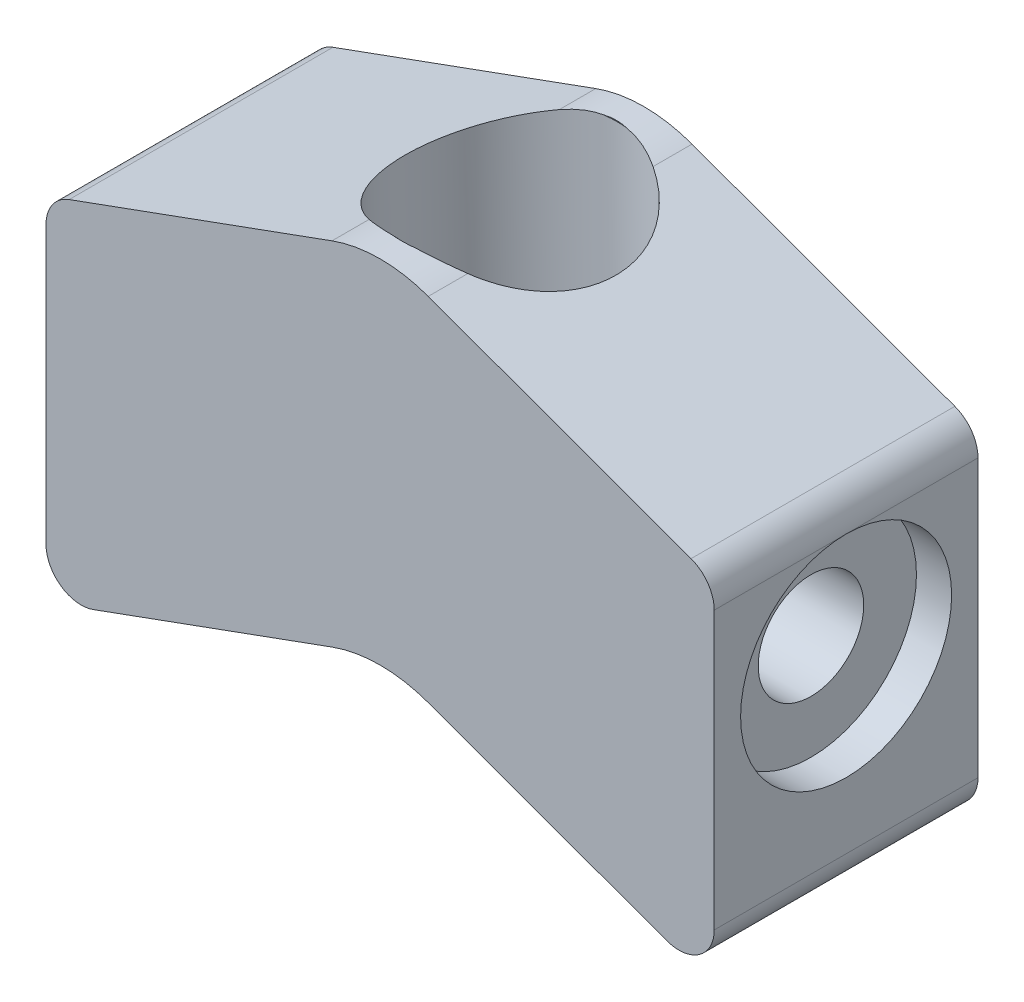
ISO-10303-21;
HEADER;
FILE_DESCRIPTION(('STEP AP214'),'2;1');
FILE_NAME('part.step','',(''),(''),'','','');
FILE_SCHEMA(('AUTOMOTIVE_DESIGN { 1 0 10303 214 1 1 1 1 }'));
ENDSEC;
DATA;
#1=APPLICATION_CONTEXT('core data for automotive mechanical design processes');
#2=APPLICATION_PROTOCOL_DEFINITION('international standard','automotive_design',2000,#1);
#3=PRODUCT_CONTEXT('',#1,'mechanical');
#4=PRODUCT('Part','Part','',(#3));
#5=PRODUCT_RELATED_PRODUCT_CATEGORY('part','',(#4));
#6=PRODUCT_DEFINITION_FORMATION('','',#4);
#7=PRODUCT_DEFINITION_CONTEXT('part definition',#1,'design');
#8=PRODUCT_DEFINITION('design','',#6,#7);
#9=PRODUCT_DEFINITION_SHAPE('','',#8);
#10=(LENGTH_UNIT() NAMED_UNIT(*) SI_UNIT(.MILLI.,.METRE.));
#11=(NAMED_UNIT(*) PLANE_ANGLE_UNIT() SI_UNIT($,.RADIAN.));
#12=(NAMED_UNIT(*) SI_UNIT($,.STERADIAN.) SOLID_ANGLE_UNIT());
#13=UNCERTAINTY_MEASURE_WITH_UNIT(LENGTH_MEASURE(1.E-05),#10,'distance_accuracy_value','');
#14=(GEOMETRIC_REPRESENTATION_CONTEXT(3) GLOBAL_UNCERTAINTY_ASSIGNED_CONTEXT((#13)) GLOBAL_UNIT_ASSIGNED_CONTEXT((#10,
#11,#12)) REPRESENTATION_CONTEXT('',''));
#15=CARTESIAN_POINT('',(0.,0.,0.));
#16=DIRECTION('',(0.,0.,1.));
#17=DIRECTION('',(1.,0.,0.));
#18=AXIS2_PLACEMENT_3D('',#15,#16,#17);
#19=CARTESIAN_POINT('',(-19.,14.2041147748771,7.5));
#20=DIRECTION('',(1.,0.,0.));
#21=DIRECTION('',(0.,0.,-1.));
#22=AXIS2_PLACEMENT_3D('',#19,#20,#21);
#23=CYLINDRICAL_SURFACE('',#22,3.);
#24=CARTESIAN_POINT('',(-5.10274213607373,14.2041147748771,4.5));
#25=CARTESIAN_POINT('',(-5.1041707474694,14.282869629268,4.50000094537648));
#26=CARTESIAN_POINT('',(-5.10738078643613,14.3616034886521,4.50310753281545));
#27=CARTESIAN_POINT('',(-5.11726853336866,14.5183790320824,4.51546712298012));
#28=CARTESIAN_POINT('',(-5.12394794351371,14.5964203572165,4.52472314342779));
#29=CARTESIAN_POINT('',(-5.14893021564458,14.8288373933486,4.56158424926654));
#30=CARTESIAN_POINT('',(-5.17217372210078,14.9813509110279,4.59828202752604));
#31=CARTESIAN_POINT('',(-5.22872337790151,15.2761346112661,4.69380659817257));
#32=CARTESIAN_POINT('',(-5.26197370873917,15.4184563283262,4.75251107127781));
#33=CARTESIAN_POINT('',(-5.33492998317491,15.6911669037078,4.89002010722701));
#34=CARTESIAN_POINT('',(-5.37463606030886,15.8215555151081,4.96882508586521));
#35=CARTESIAN_POINT('',(-5.46033207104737,16.0789913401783,5.15225188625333));
#36=CARTESIAN_POINT('',(-5.50656885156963,16.2047916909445,5.25850880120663));
#37=CARTESIAN_POINT('',(-5.597772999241,16.4376600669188,5.49044870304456));
#38=CARTESIAN_POINT('',(-5.64273971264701,16.544718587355,5.61614148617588));
#39=CARTESIAN_POINT('',(-5.7297399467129,16.7434488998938,5.89296948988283));
#40=CARTESIAN_POINT('',(-5.77142325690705,16.8337703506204,6.04519371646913));
#41=CARTESIAN_POINT('',(-5.84385154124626,16.9868937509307,6.36529816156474));
#42=CARTESIAN_POINT('',(-5.87460454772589,17.0497159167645,6.53316676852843));
#43=CARTESIAN_POINT('',(-5.91954451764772,17.140902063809,6.86552470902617));
#44=CARTESIAN_POINT('',(-5.93485802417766,17.1716166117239,7.02921389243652));
#45=CARTESIAN_POINT('',(-5.95127264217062,17.2054527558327,7.36008873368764));
#46=CARTESIAN_POINT('',(-5.95238249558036,17.2085913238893,7.52727217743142));
#47=CARTESIAN_POINT('',(-5.94079876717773,17.1881387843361,7.84431516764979));
#48=CARTESIAN_POINT('',(-5.92933627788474,17.166923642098,7.99438176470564));
#49=CARTESIAN_POINT('',(-5.89560082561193,17.1025643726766,8.28844683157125));
#50=CARTESIAN_POINT('',(-5.87332690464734,17.0594183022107,8.43244476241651));
#51=CARTESIAN_POINT('',(-5.81943820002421,16.9519692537,8.71339488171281));
#52=CARTESIAN_POINT('',(-5.78766571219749,16.8873068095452,8.85017817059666));
#53=CARTESIAN_POINT('',(-5.71757500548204,16.739144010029,9.11126857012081));
#54=CARTESIAN_POINT('',(-5.67925439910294,16.655636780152,9.23557110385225));
#55=CARTESIAN_POINT('',(-5.59497200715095,16.4624845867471,9.4815707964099));
#56=CARTESIAN_POINT('',(-5.54862937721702,16.3510510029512,9.60173510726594));
#57=CARTESIAN_POINT('',(-5.45584056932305,16.110147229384,9.82245351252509));
#58=CARTESIAN_POINT('',(-5.40939433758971,15.9806623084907,9.92299142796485));
#59=CARTESIAN_POINT('',(-5.31785503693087,15.6961185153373,10.1085783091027));
#60=CARTESIAN_POINT('',(-5.27308532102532,15.5399029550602,10.1920464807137));
#61=CARTESIAN_POINT('',(-5.21421882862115,15.2948541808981,10.2961028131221));
#62=CARTESIAN_POINT('',(-5.19597501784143,15.2113648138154,10.3272683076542));
#63=CARTESIAN_POINT('',(-5.16292380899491,15.0413427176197,10.3821888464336));
#64=CARTESIAN_POINT('',(-5.14811426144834,14.9548119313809,10.4059485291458));
#65=CARTESIAN_POINT('',(-5.1235388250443,14.7862554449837,10.4441448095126));
#66=CARTESIAN_POINT('',(-5.11346936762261,14.7044056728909,10.4591645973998));
#67=CARTESIAN_POINT('',(-5.09714101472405,14.5394043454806,10.4823676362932));
#68=CARTESIAN_POINT('',(-5.09088009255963,14.4562535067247,10.4905545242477));
#69=CARTESIAN_POINT('',(-5.08239546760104,14.2893838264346,10.4999509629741));
#70=CARTESIAN_POINT('',(-5.08016996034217,14.2056652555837,10.5011636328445));
#71=CARTESIAN_POINT('',(-5.07979835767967,14.0384373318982,10.4965911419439));
#72=CARTESIAN_POINT('',(-5.08165194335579,13.9549279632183,10.4908065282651));
#73=CARTESIAN_POINT('',(-5.09228556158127,13.7253107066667,10.4652039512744));
#74=CARTESIAN_POINT('',(-5.1052765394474,13.5801386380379,10.4380396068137));
#75=CARTESIAN_POINT('',(-5.14180412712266,13.296667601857,10.3632311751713));
#76=CARTESIAN_POINT('',(-5.16534412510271,13.1583708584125,10.3155805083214));
#77=CARTESIAN_POINT('',(-5.22119566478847,12.8861243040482,10.199198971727));
#78=CARTESIAN_POINT('',(-5.25381902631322,12.7525665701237,10.1297045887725));
#79=CARTESIAN_POINT('',(-5.32383836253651,12.4981784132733,9.97228436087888));
#80=CARTESIAN_POINT('',(-5.36123666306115,12.3773542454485,9.88434952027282));
#81=CARTESIAN_POINT('',(-5.44209930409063,12.1360786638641,9.67973877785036));
#82=CARTESIAN_POINT('',(-5.48573793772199,12.0175581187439,9.56084502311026));
#83=CARTESIAN_POINT('',(-5.57007183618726,11.8014976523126,9.30431784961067));
#84=CARTESIAN_POINT('',(-5.61076607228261,11.703965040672,9.1666779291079));
#85=CARTESIAN_POINT('',(-5.68613704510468,11.5300625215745,8.87102821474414));
#86=CARTESIAN_POINT('',(-5.72059294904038,11.454427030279,8.71252596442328));
#87=CARTESIAN_POINT('',(-5.77790910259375,11.3316037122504,8.38291686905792));
#88=CARTESIAN_POINT('',(-5.80077864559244,11.2843930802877,8.21182025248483));
#89=CARTESIAN_POINT('',(-5.83080257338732,11.2235530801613,7.87762127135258));
#90=CARTESIAN_POINT('',(-5.83913167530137,11.2074014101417,7.71508301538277));
#91=CARTESIAN_POINT('',(-5.8428899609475,11.2017382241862,7.38941676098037));
#92=CARTESIAN_POINT('',(-5.83832350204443,11.2122177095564,7.22628898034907));
#93=CARTESIAN_POINT('',(-5.81753856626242,11.257786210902,6.91488798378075));
#94=CARTESIAN_POINT('',(-5.80207177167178,11.2912843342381,6.7663261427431));
#95=CARTESIAN_POINT('',(-5.76182333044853,11.3798254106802,6.4771271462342));
#96=CARTESIAN_POINT('',(-5.73704039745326,11.434871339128,6.33649108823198));
#97=CARTESIAN_POINT('',(-5.67924229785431,11.5672713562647,6.06076760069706));
#98=CARTESIAN_POINT('',(-5.64593577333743,11.6454346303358,5.92613177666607));
#99=CARTESIAN_POINT('',(-5.57467464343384,11.8208748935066,5.67130647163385));
#100=CARTESIAN_POINT('',(-5.53671790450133,11.9181606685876,5.55112367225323));
#101=CARTESIAN_POINT('',(-5.4559422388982,12.1395771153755,5.3168757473));
#102=CARTESIAN_POINT('',(-5.41299914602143,12.2653618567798,5.20441551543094));
#103=CARTESIAN_POINT('',(-5.33031425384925,12.5348873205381,5.00158014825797));
#104=CARTESIAN_POINT('',(-5.29057498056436,12.678641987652,4.9112223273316));
#105=CARTESIAN_POINT('',(-5.23681668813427,12.9070253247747,4.79349863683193));
#106=CARTESIAN_POINT('',(-5.21970719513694,12.9862896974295,4.75690573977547));
#107=CARTESIAN_POINT('',(-5.18833710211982,13.148178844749,4.69061635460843));
#108=CARTESIAN_POINT('',(-5.17407502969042,13.2308018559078,4.66091630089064));
#109=CARTESIAN_POINT('',(-5.14904743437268,13.398601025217,4.60883276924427));
#110=CARTESIAN_POINT('',(-5.13827303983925,13.4837700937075,4.58643072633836));
#111=CARTESIAN_POINT('',(-5.12069547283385,13.6561003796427,4.54916263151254));
#112=CARTESIAN_POINT('',(-5.1138895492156,13.7432601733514,4.53429135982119));
#113=CARTESIAN_POINT('',(-5.1059765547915,13.892807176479,4.51554511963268));
#114=CARTESIAN_POINT('',(-5.10377954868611,13.9549003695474,4.50971901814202));
#115=CARTESIAN_POINT('',(-5.10159664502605,14.0793716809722,4.50194600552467));
#116=CARTESIAN_POINT('',(-5.10161083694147,14.1417498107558,4.49999925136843));
#117=CARTESIAN_POINT('',(-5.10274213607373,14.2041147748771,4.5));
#118=B_SPLINE_CURVE_WITH_KNOTS('',3,(#24,#25,#26,#27,#28,#29,#30,#31,#32,#33,#34,#35,#36,#37,
#38,#39,#40,#41,#42,#43,#44,#45,#46,#47,#48,#49,#50,#51,#52,#53,#54,#55,#56,#57,#58,#59,#60,#61,
#62,#63,#64,#65,#66,#67,#68,#69,#70,#71,#72,#73,#74,#75,#76,#77,#78,#79,#80,#81,#82,#83,#84,#85,
#86,#87,#88,#89,#90,#91,#92,#93,#94,#95,#96,#97,#98,#99,#100,#101,#102,#103,#104,#105,#106,#107,
#108,#109,#110,#111,#112,#113,#114,#115,#116,#117),.UNSPECIFIED.,.T.,.F.,(4,2,2,2,2,2,2,2,2,2,2,
2,2,2,2,2,2,2,2,2,2,2,2,2,2,2,2,2,2,2,2,2,2,2,2,2,2,2,2,2,2,2,2,2,2,2,4),(0.,0.236234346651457,
0.472584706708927,0.945744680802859,1.41631278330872,1.88689062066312,2.39784947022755,
2.90906670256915,3.45170831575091,3.99395033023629,4.49290239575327,4.99154735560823,
5.44539589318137,5.89928465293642,6.36117270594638,6.82322952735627,7.33198233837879,
7.84115278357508,8.38603284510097,8.65858866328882,8.93097342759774,9.1820858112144,
9.43306444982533,9.6839308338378,9.9347776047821,10.3773369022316,10.8200384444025,
11.2803595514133,11.7409057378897,12.2589659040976,12.7772062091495,13.3112188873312,
13.8448025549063,14.3328437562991,14.8207200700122,15.2778808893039,15.7351048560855,
16.2107438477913,16.6866018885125,17.2066560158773,17.7271162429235,17.993697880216,
18.2601413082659,18.525901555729,18.7914773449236,18.9785407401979,19.1656117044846),.UNSPECIFIED.);
#119=CARTESIAN_POINT('',(-5.10274213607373,14.2041147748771,4.5));
#120=VERTEX_POINT('',#119);
#121=EDGE_CURVE('E313',#120,#120,#118,.T.);
#122=ORIENTED_EDGE('',*,*,#121,.T.);
#123=EDGE_LOOP('',(#122));
#124=FACE_BOUND('',#123,.T.);
#125=CARTESIAN_POINT('',(-17.,14.2041147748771,7.5));
#126=DIRECTION('',(1.,0.,0.));
#127=DIRECTION('',(0.,0.,-1.));
#128=AXIS2_PLACEMENT_3D('',#125,#126,#127);
#129=CIRCLE('',#128,3.);
#130=CARTESIAN_POINT('',(-17.,14.2041147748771,4.5));
#131=VERTEX_POINT('',#130);
#132=EDGE_CURVE('E377',#131,#131,#129,.T.);
#133=ORIENTED_EDGE('',*,*,#132,.F.);
#134=EDGE_LOOP('',(#133));
#135=FACE_BOUND('',#134,.T.);
#136=ADVANCED_FACE('F39',(#124,#135),#23,.F.);
#137=CARTESIAN_POINT('',(0.,0.,15.));
#138=DIRECTION('',(0.,0.,-1.));
#139=DIRECTION('',(-1.,0.,0.));
#140=AXIS2_PLACEMENT_3D('',#137,#138,#139);
#141=CYLINDRICAL_SURFACE('',#140,8.);
#142=DIRECTION('',(0.,0.,-1.));
#143=VECTOR('',#142,1.);
#144=CARTESIAN_POINT('',(2.73616114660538,7.51754096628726,15.));
#145=LINE('',#144,#143);
#146=CARTESIAN_POINT('',(2.73616114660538,7.51754096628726,2.03096166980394));
#147=VERTEX_POINT('',#146);
#148=CARTESIAN_POINT('',(2.73616114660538,7.51754096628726,0.));
#149=VERTEX_POINT('',#148);
#150=EDGE_CURVE('E268',#147,#149,#145,.T.);
#151=ORIENTED_EDGE('',*,*,#150,.F.);
#152=CARTESIAN_POINT('',(2.73616114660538,7.51754096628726,2.03096166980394));
#153=CARTESIAN_POINT('',(2.61232678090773,7.56262916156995,1.97431822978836));
#154=CARTESIAN_POINT('',(2.48578915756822,7.60520376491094,1.92148051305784));
#155=CARTESIAN_POINT('',(2.22779684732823,7.68473105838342,1.8239553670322));
#156=CARTESIAN_POINT('',(2.09633882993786,7.72167985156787,1.77927358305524));
#157=CARTESIAN_POINT('',(1.82886143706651,7.7893743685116,1.6985865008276));
#158=CARTESIAN_POINT('',(1.69283229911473,7.82010568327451,1.6626013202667));
#159=CARTESIAN_POINT('',(1.4173112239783,7.87470260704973,1.59998660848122));
#160=CARTESIAN_POINT('',(1.27782009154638,7.8985697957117,1.57335492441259));
#161=CARTESIAN_POINT('',(0.995646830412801,7.93908623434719,1.52980005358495));
#162=CARTESIAN_POINT('',(0.852953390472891,7.95570337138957,1.51291995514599));
#163=CARTESIAN_POINT('',(0.566042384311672,7.98124900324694,1.48939449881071));
#164=CARTESIAN_POINT('',(0.421824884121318,7.99017782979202,1.48274869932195));
#165=CARTESIAN_POINT('',(0.133269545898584,8.00019021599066,1.47988060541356));
#166=CARTESIAN_POINT('',(-0.011067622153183,8.00128769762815,1.48363979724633));
#167=CARTESIAN_POINT('',(-0.298933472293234,7.99570887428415,1.50155500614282));
#168=CARTESIAN_POINT('',(-0.442462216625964,7.98903317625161,1.51571021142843));
#169=CARTESIAN_POINT('',(-0.719420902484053,7.96872649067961,1.55315151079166));
#170=CARTESIAN_POINT('',(-0.852959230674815,7.9555147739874,1.57586958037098));
#171=CARTESIAN_POINT('',(-1.11747701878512,7.92268981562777,1.63015227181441));
#172=CARTESIAN_POINT('',(-1.24845543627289,7.90307402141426,1.66172042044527));
#173=CARTESIAN_POINT('',(-1.50704162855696,7.85786617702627,1.73335048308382));
#174=CARTESIAN_POINT('',(-1.63464849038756,7.83227252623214,1.7734146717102));
#175=CARTESIAN_POINT('',(-1.8858003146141,7.77562419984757,1.86161193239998));
#176=CARTESIAN_POINT('',(-2.00934500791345,7.74456916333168,1.90974553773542));
#177=CARTESIAN_POINT('',(-2.23529243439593,7.68213970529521,2.00654011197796));
#178=CARTESIAN_POINT('',(-2.3382831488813,7.65138468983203,2.05423663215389));
#179=CARTESIAN_POINT('',(-2.54021918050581,7.58673248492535,2.15484039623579));
#180=CARTESIAN_POINT('',(-2.63917661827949,7.5528458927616,2.20773010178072));
#181=CARTESIAN_POINT('',(-2.73616114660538,7.51754096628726,2.26314372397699));
#182=B_SPLINE_CURVE_WITH_KNOTS('',3,(#152,#153,#154,#155,#156,#157,#158,#159,#160,#161,#162,
#163,#164,#165,#166,#167,#168,#169,#170,#171,#172,#173,#174,#175,#176,#177,#178,#179,#180,#181),
.UNSPECIFIED.,.F.,.F.,(4,2,2,2,2,2,2,2,2,2,2,2,2,2,4),(0.,0.430297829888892,0.860892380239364,
1.2924736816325,1.72395558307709,2.15732972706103,2.59068517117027,3.0232700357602,
3.45582112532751,3.8636534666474,4.27164856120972,4.67975302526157,5.08788446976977,
5.44043672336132,5.79183681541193),.UNSPECIFIED.);
#183=CARTESIAN_POINT('',(-2.73616114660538,7.51754096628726,2.26314372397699));
#184=VERTEX_POINT('',#183);
#185=EDGE_CURVE('E289',#147,#184,#182,.T.);
#186=ORIENTED_EDGE('',*,*,#185,.T.);
#187=DIRECTION('',(0.,0.,-1.));
#188=VECTOR('',#187,1.);
#189=CARTESIAN_POINT('',(-2.73616114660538,7.51754096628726,15.));
#190=LINE('',#189,#188);
#191=CARTESIAN_POINT('',(-2.73616114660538,7.51754096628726,0.));
#192=VERTEX_POINT('',#191);
#193=EDGE_CURVE('E418',#184,#192,#190,.T.);
#194=ORIENTED_EDGE('',*,*,#193,.T.);
#195=CARTESIAN_POINT('',(0.,0.,0.));
#196=DIRECTION('',(0.,0.,-1.));
#197=DIRECTION('',(1.,0.,0.));
#198=AXIS2_PLACEMENT_3D('',#195,#196,#197);
#199=CIRCLE('',#198,8.);
#200=EDGE_CURVE('E393',#192,#149,#199,.T.);
#201=ORIENTED_EDGE('',*,*,#200,.T.);
#202=EDGE_LOOP('',(#151,#186,#194,#201));
#203=FACE_BOUND('',#202,.T.);
#204=ADVANCED_FACE('F365',(#203),#141,.F.);
#205=CARTESIAN_POINT('',(0.,20.0065421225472,15.));
#206=DIRECTION('',(0.,0.,-1.));
#207=DIRECTION('',(-1.,0.,0.));
#208=AXIS2_PLACEMENT_3D('',#205,#206,#207);
#209=CYLINDRICAL_SURFACE('',#208,8.);
#210=DIRECTION('',(0.,0.,-1.));
#211=VECTOR('',#210,1.);
#212=CARTESIAN_POINT('',(2.73616114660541,27.5240830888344,15.));
#213=LINE('',#212,#211);
#214=CARTESIAN_POINT('',(2.73616114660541,27.5240830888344,15.));
#215=VERTEX_POINT('',#214);
#216=CARTESIAN_POINT('',(2.73616114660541,27.5240830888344,12.7490193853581));
#217=VERTEX_POINT('',#216);
#218=EDGE_CURVE('E251',#215,#217,#213,.T.);
#219=ORIENTED_EDGE('',*,*,#218,.T.);
#220=CARTESIAN_POINT('',(2.73616114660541,27.5240830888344,12.7490193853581));
#221=CARTESIAN_POINT('',(2.61025384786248,27.5699269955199,12.8172089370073));
#222=CARTESIAN_POINT('',(2.48118978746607,27.6133029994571,12.8813407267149));
#223=CARTESIAN_POINT('',(2.21717460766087,27.6944002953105,13.0009241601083));
#224=CARTESIAN_POINT('',(2.082215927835,27.7321140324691,13.0563642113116));
#225=CARTESIAN_POINT('',(1.8098851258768,27.8003631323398,13.1568157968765));
#226=CARTESIAN_POINT('',(1.67261302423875,27.8310253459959,13.2020113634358));
#227=CARTESIAN_POINT('',(1.39402053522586,27.8854266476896,13.2827198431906));
#228=CARTESIAN_POINT('',(1.25270374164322,27.9091716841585,13.3182410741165));
#229=CARTESIAN_POINT('',(1.00779255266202,27.9434788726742,13.3704077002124));
#230=CARTESIAN_POINT('',(0.904976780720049,27.9558690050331,13.3895458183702));
#231=CARTESIAN_POINT('',(0.697366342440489,27.9767785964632,13.4226188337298));
#232=CARTESIAN_POINT('',(0.592562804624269,27.9852699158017,13.4365157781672));
#233=CARTESIAN_POINT('',(0.487319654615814,27.9916858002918,13.4476424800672));
#234=B_SPLINE_CURVE_WITH_KNOTS('',3,(#220,#221,#222,#223,#224,#225,#226,#227,#228,#229,#230,
#231,#232,#233),.UNSPECIFIED.,.F.,.F.,(4,2,2,2,2,2,4),(0.,0.451010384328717,0.902617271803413,
1.3453216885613,1.78764426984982,2.10337973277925,2.42135952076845),.UNSPECIFIED.);
#235=CARTESIAN_POINT('',(0.487319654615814,27.9916858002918,13.4476424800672));
#236=VERTEX_POINT('',#235);
#237=EDGE_CURVE('E11',#217,#236,#234,.T.);
#238=ORIENTED_EDGE('',*,*,#237,.T.);
#239=CARTESIAN_POINT('',(1.53557960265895,27.8577837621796,13.0823032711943));
#240=CARTESIAN_POINT('',(1.45180080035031,27.8741755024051,13.1260003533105));
#241=CARTESIAN_POINT('',(1.36628940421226,27.8895018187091,13.1668421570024));
#242=CARTESIAN_POINT('',(1.1920950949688,27.9177164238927,13.242309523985));
#243=CARTESIAN_POINT('',(1.10340956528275,27.9306026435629,13.2769298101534));
#244=CARTESIAN_POINT('',(0.923334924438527,27.9535970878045,13.3393619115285));
#245=CARTESIAN_POINT('',(0.831946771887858,27.9637062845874,13.367176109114));
#246=CARTESIAN_POINT('',(0.647035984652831,27.9808753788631,13.4155223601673));
#247=CARTESIAN_POINT('',(0.553513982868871,27.987936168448,13.4360565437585));
#248=CARTESIAN_POINT('',(0.2694992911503,28.0042459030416,13.4862881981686));
#249=CARTESIAN_POINT('',(0.0764554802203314,28.0085038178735,13.5042980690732));
#250=CARTESIAN_POINT('',(-0.309426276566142,28.0028842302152,13.5074985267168));
#251=CARTESIAN_POINT('',(-0.502264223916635,27.9930216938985,13.4927238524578));
#252=CARTESIAN_POINT('',(-0.837700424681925,27.9639134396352,13.4388731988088));
#253=CARTESIAN_POINT('',(-0.981604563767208,27.9473649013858,13.4062067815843));
#254=CARTESIAN_POINT('',(-1.19296411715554,27.9174156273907,13.344495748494));
#255=CARTESIAN_POINT('',(-1.26270284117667,27.9065711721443,13.3217917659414));
#256=CARTESIAN_POINT('',(-1.40046653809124,27.883316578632,13.2723779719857));
#257=CARTESIAN_POINT('',(-1.46849182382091,27.8709067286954,13.2456688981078));
#258=CARTESIAN_POINT('',(-1.53557960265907,27.8577837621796,13.2170695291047));
#259=B_SPLINE_CURVE_WITH_KNOTS('',3,(#239,#240,#241,#242,#243,#244,#245,#246,#247,#248,#249,
#250,#251,#252,#253,#254,#255,#256,#257,#258),.UNSPECIFIED.,.F.,.F.,(4,2,2,2,2,2,2,2,2,4),(0.,
0.287683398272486,0.5756096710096,0.863435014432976,1.15117607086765,1.72949640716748,
2.30720423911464,2.75132109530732,2.97361009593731,3.19585821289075),.UNSPECIFIED.);
#260=CARTESIAN_POINT('',(-0.776395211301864,27.9687786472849,13.4476424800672));
#261=VERTEX_POINT('',#260);
#262=EDGE_CURVE('E186',#236,#261,#259,.T.);
#263=ORIENTED_EDGE('',*,*,#262,.T.);
#264=CARTESIAN_POINT('',(-0.776395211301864,27.9687786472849,13.4476424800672));
#265=CARTESIAN_POINT('',(-0.92292103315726,27.9545212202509,13.4321258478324));
#266=CARTESIAN_POINT('',(-1.06843992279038,27.9362199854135,13.41117925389));
#267=CARTESIAN_POINT('',(-1.35640276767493,27.8920512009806,13.3588917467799));
#268=CARTESIAN_POINT('',(-1.49884739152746,27.8661853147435,13.3275531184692));
#269=CARTESIAN_POINT('',(-1.77743704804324,27.8078683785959,13.2555162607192));
#270=CARTESIAN_POINT('',(-1.91364618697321,27.7755283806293,13.2149745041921));
#271=CARTESIAN_POINT('',(-2.18131107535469,27.7046604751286,13.1248308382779));
#272=CARTESIAN_POINT('',(-2.31276893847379,27.6661353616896,13.0752330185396));
#273=CARTESIAN_POINT('',(-2.49138020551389,27.6088950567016,13.000569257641));
#274=CARTESIAN_POINT('',(-2.54082454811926,27.5925093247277,12.9790978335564));
#275=CARTESIAN_POINT('',(-2.63904261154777,27.5589029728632,12.9348480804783));
#276=CARTESIAN_POINT('',(-2.68781373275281,27.5416798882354,12.9120658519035));
#277=CARTESIAN_POINT('',(-2.73616114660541,27.5240830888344,12.8886761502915));
#278=B_SPLINE_CURVE_WITH_KNOTS('',3,(#264,#265,#266,#267,#268,#269,#270,#271,#272,#273,#274,
#275,#276,#277),.UNSPECIFIED.,.F.,.F.,(4,2,2,2,2,2,4),(0.,0.443890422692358,0.887683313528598,
1.32443135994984,1.76098265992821,1.92998536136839,2.099519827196),.UNSPECIFIED.);
#279=CARTESIAN_POINT('',(-2.73616114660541,27.5240830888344,12.8886761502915));
#280=VERTEX_POINT('',#279);
#281=EDGE_CURVE('E54',#261,#280,#278,.T.);
#282=ORIENTED_EDGE('',*,*,#281,.T.);
#283=DIRECTION('',(0.,0.,-1.));
#284=VECTOR('',#283,1.);
#285=CARTESIAN_POINT('',(-2.73616114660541,27.5240830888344,15.));
#286=LINE('',#285,#284);
#287=CARTESIAN_POINT('',(-2.73616114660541,27.5240830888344,15.));
#288=VERTEX_POINT('',#287);
#289=EDGE_CURVE('E252',#288,#280,#286,.T.);
#290=ORIENTED_EDGE('',*,*,#289,.F.);
#291=CARTESIAN_POINT('',(0.,20.0065421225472,15.));
#292=DIRECTION('',(0.,0.,1.));
#293=DIRECTION('',(-1.,0.,0.));
#294=AXIS2_PLACEMENT_3D('',#291,#292,#293);
#295=CIRCLE('',#294,8.);
#296=EDGE_CURVE('E406',#215,#288,#295,.T.);
#297=ORIENTED_EDGE('',*,*,#296,.F.);
#298=EDGE_LOOP('',(#219,#238,#263,#282,#290,#297));
#299=FACE_BOUND('',#298,.T.);
#300=ADVANCED_FACE('F191',(#299),#209,.T.);
#301=CARTESIAN_POINT('',(-19.,4.45428374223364,15.));
#302=DIRECTION('',(1.,0.,0.));
#303=DIRECTION('',(0.,0.,-1.));
#304=AXIS2_PLACEMENT_3D('',#301,#302,#303);
#305=PLANE('',#304);
#306=DIRECTION('',(0.,0.,-1.));
#307=VECTOR('',#306,1.);
#308=CARTESIAN_POINT('',(-19.,20.2041147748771,15.));
#309=LINE('',#308,#307);
#310=CARTESIAN_POINT('',(-19.,20.2041147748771,15.));
#311=VERTEX_POINT('',#310);
#312=CARTESIAN_POINT('',(-19.,20.2041147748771,7.5));
#313=VERTEX_POINT('',#312);
#314=EDGE_CURVE('E452',#311,#313,#309,.T.);
#315=ORIENTED_EDGE('',*,*,#314,.T.);
#316=CARTESIAN_POINT('',(-19.,14.2041147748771,7.5));
#317=DIRECTION('',(1.,0.,0.));
#318=DIRECTION('',(0.,0.,-1.));
#319=AXIS2_PLACEMENT_3D('',#316,#317,#318);
#320=CIRCLE('',#319,6.);
#321=EDGE_CURVE('E379',#313,#313,#320,.T.);
#322=ORIENTED_EDGE('',*,*,#321,.T.);
#323=CARTESIAN_POINT('',(-19.,20.2041147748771,0.));
#324=VERTEX_POINT('',#323);
#325=EDGE_CURVE('E451',#313,#324,#309,.T.);
#326=ORIENTED_EDGE('',*,*,#325,.T.);
#327=DIRECTION('',(0.,-1.,0.));
#328=VECTOR('',#327,1.);
#329=CARTESIAN_POINT('',(-19.,4.45428374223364,0.));
#330=LINE('',#329,#328);
#331=CARTESIAN_POINT('',(-19.,4.45428374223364,0.));
#332=VERTEX_POINT('',#331);
#333=EDGE_CURVE('E438',#324,#332,#330,.T.);
#334=ORIENTED_EDGE('',*,*,#333,.T.);
#335=DIRECTION('',(0.,0.,-1.));
#336=VECTOR('',#335,1.);
#337=CARTESIAN_POINT('',(-19.,4.45428374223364,15.));
#338=LINE('',#337,#336);
#339=CARTESIAN_POINT('',(-19.,4.45428374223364,15.));
#340=VERTEX_POINT('',#339);
#341=EDGE_CURVE('E448',#340,#332,#338,.T.);
#342=ORIENTED_EDGE('',*,*,#341,.F.);
#343=DIRECTION('',(0.,-1.,0.));
#344=VECTOR('',#343,1.);
#345=CARTESIAN_POINT('',(-19.,4.45428374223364,15.));
#346=LINE('',#345,#344);
#347=EDGE_CURVE('E412',#311,#340,#346,.T.);
#348=ORIENTED_EDGE('',*,*,#347,.F.);
#349=EDGE_LOOP('',(#315,#322,#326,#334,#342,#348));
#350=FACE_BOUND('',#349,.T.);
#351=ADVANCED_FACE('F323',(#350),#305,.F.);
#352=CARTESIAN_POINT('',(5.31310144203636,14.2041147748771,4.5));
#353=CARTESIAN_POINT('',(5.31453005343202,14.1253599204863,4.50000094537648));
#354=CARTESIAN_POINT('',(5.31774009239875,14.0466260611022,4.50310753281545));
#355=CARTESIAN_POINT('',(5.32762783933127,13.8898505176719,4.51546712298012));
#356=CARTESIAN_POINT('',(5.33430724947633,13.8118091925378,4.52472314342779));
#357=CARTESIAN_POINT('',(5.3592895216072,13.5793921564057,4.56158424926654));
#358=CARTESIAN_POINT('',(5.3825330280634,13.4268786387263,4.59828202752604));
#359=CARTESIAN_POINT('',(5.43908268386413,13.1320949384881,4.69380659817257));
#360=CARTESIAN_POINT('',(5.47233301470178,12.989773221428,4.75251107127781));
#361=CARTESIAN_POINT('',(5.54528928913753,12.7170626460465,4.89002010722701));
#362=CARTESIAN_POINT('',(5.58499536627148,12.5866740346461,4.96882508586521));
#363=CARTESIAN_POINT('',(5.67069137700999,12.329238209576,5.15225188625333));
#364=CARTESIAN_POINT('',(5.71692815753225,12.2034378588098,5.25850880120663));
#365=CARTESIAN_POINT('',(5.80813230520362,11.9705694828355,5.49044870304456));
#366=CARTESIAN_POINT('',(5.85309901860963,11.8635109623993,5.61614148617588));
#367=CARTESIAN_POINT('',(5.94009925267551,11.6647806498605,5.89296948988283));
#368=CARTESIAN_POINT('',(5.98178256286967,11.5744591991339,6.04519371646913));
#369=CARTESIAN_POINT('',(6.05421084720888,11.4213357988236,6.36529816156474));
#370=CARTESIAN_POINT('',(6.0849638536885,11.3585136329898,6.53316676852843));
#371=CARTESIAN_POINT('',(6.12990382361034,11.2673274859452,6.86552470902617));
#372=CARTESIAN_POINT('',(6.14521733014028,11.2366129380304,7.02921389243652));
#373=CARTESIAN_POINT('',(6.16163194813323,11.2027767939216,7.36008873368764));
#374=CARTESIAN_POINT('',(6.16274180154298,11.199638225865,7.52727217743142));
#375=CARTESIAN_POINT('',(6.15115807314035,11.2200907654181,7.8443151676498));
#376=CARTESIAN_POINT('',(6.13969558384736,11.2413059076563,7.99438176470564));
#377=CARTESIAN_POINT('',(6.10596013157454,11.3056651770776,8.28844683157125));
#378=CARTESIAN_POINT('',(6.08368621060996,11.3488112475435,8.43244476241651));
#379=CARTESIAN_POINT('',(6.02979750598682,11.4562602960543,8.71339488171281));
#380=CARTESIAN_POINT('',(5.9980250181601,11.5209227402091,8.85017817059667));
#381=CARTESIAN_POINT('',(5.92793431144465,11.6690855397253,9.11126857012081));
#382=CARTESIAN_POINT('',(5.88961370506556,11.7525927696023,9.23557110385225));
#383=CARTESIAN_POINT('',(5.80533131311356,11.9457449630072,9.48157079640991));
#384=CARTESIAN_POINT('',(5.75898868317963,12.0571785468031,9.60173510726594));
#385=CARTESIAN_POINT('',(5.66619987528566,12.2980823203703,9.82245351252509));
#386=CARTESIAN_POINT('',(5.61975364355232,12.4275672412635,9.92299142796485));
#387=CARTESIAN_POINT('',(5.52821434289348,12.7121110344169,10.1085783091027));
#388=CARTESIAN_POINT('',(5.48344462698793,12.868326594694,10.1920464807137));
#389=CARTESIAN_POINT('',(5.42457813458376,13.1133753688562,10.2961028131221));
#390=CARTESIAN_POINT('',(5.40633432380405,13.1968647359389,10.3272683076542));
#391=CARTESIAN_POINT('',(5.37328311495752,13.3668868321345,10.3821888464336));
#392=CARTESIAN_POINT('',(5.35847356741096,13.4534176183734,10.4059485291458));
#393=CARTESIAN_POINT('',(5.33389813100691,13.6219741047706,10.4441448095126));
#394=CARTESIAN_POINT('',(5.32382867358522,13.7038238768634,10.4591645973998));
#395=CARTESIAN_POINT('',(5.30750032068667,13.8688252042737,10.4823676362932));
#396=CARTESIAN_POINT('',(5.30123939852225,13.9519760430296,10.4905545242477));
#397=CARTESIAN_POINT('',(5.29275477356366,14.1188457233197,10.4999509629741));
#398=CARTESIAN_POINT('',(5.29052926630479,14.2025642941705,10.5011636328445));
#399=CARTESIAN_POINT('',(5.29015766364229,14.369792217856,10.4965911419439));
#400=CARTESIAN_POINT('',(5.29201124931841,14.453301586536,10.4908065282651));
#401=CARTESIAN_POINT('',(5.30264486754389,14.6829188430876,10.4652039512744));
#402=CARTESIAN_POINT('',(5.31563584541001,14.8280909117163,10.4380396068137));
#403=CARTESIAN_POINT('',(5.35216343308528,15.1115619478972,10.3632311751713));
#404=CARTESIAN_POINT('',(5.37570343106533,15.2498586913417,10.3155805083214));
#405=CARTESIAN_POINT('',(5.43155497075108,15.5221052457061,10.199198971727));
#406=CARTESIAN_POINT('',(5.46417833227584,15.6556629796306,10.1297045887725));
#407=CARTESIAN_POINT('',(5.53419766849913,15.910051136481,9.97228436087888));
#408=CARTESIAN_POINT('',(5.57159596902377,16.0308753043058,9.88434952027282));
#409=CARTESIAN_POINT('',(5.65245861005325,16.2721508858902,9.67973877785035));
#410=CARTESIAN_POINT('',(5.69609724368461,16.3906714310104,9.56084502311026));
#411=CARTESIAN_POINT('',(5.78043114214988,16.6067318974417,9.30431784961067));
#412=CARTESIAN_POINT('',(5.82112537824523,16.7042645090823,9.1666779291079));
#413=CARTESIAN_POINT('',(5.8964963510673,16.8781670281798,8.87102821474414));
#414=CARTESIAN_POINT('',(5.930952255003,16.9538025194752,8.71252596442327));
#415=CARTESIAN_POINT('',(5.98826840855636,17.0766258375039,8.38291686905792));
#416=CARTESIAN_POINT('',(6.01113795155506,17.1238364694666,8.21182025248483));
#417=CARTESIAN_POINT('',(6.04116187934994,17.184676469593,7.87762127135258));
#418=CARTESIAN_POINT('',(6.04949098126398,17.2008281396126,7.71508301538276));
#419=CARTESIAN_POINT('',(6.05324926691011,17.206491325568,7.38941676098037));
#420=CARTESIAN_POINT('',(6.04868280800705,17.1960118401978,7.22628898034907));
#421=CARTESIAN_POINT('',(6.02789787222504,17.1504433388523,6.91488798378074));
#422=CARTESIAN_POINT('',(6.01243107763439,17.1169452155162,6.76632614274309));
#423=CARTESIAN_POINT('',(5.97218263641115,17.0284041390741,6.4771271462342));
#424=CARTESIAN_POINT('',(5.94739970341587,16.9733582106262,6.33649108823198));
#425=CARTESIAN_POINT('',(5.88960160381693,16.8409581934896,6.06076760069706));
#426=CARTESIAN_POINT('',(5.85629507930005,16.7627949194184,5.92613177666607));
#427=CARTESIAN_POINT('',(5.78503394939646,16.5873546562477,5.67130647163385));
#428=CARTESIAN_POINT('',(5.74707721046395,16.4900688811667,5.55112367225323));
#429=CARTESIAN_POINT('',(5.66630154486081,16.2686524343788,5.3168757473));
#430=CARTESIAN_POINT('',(5.62335845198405,16.1428676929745,5.20441551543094));
#431=CARTESIAN_POINT('',(5.54067355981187,15.8733422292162,5.00158014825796));
#432=CARTESIAN_POINT('',(5.50093428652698,15.7295875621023,4.9112223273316));
#433=CARTESIAN_POINT('',(5.44717599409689,15.5012042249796,4.79349863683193));
#434=CARTESIAN_POINT('',(5.43006650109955,15.4219398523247,4.75690573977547));
#435=CARTESIAN_POINT('',(5.39869640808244,15.2600507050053,4.69061635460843));
#436=CARTESIAN_POINT('',(5.38443433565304,15.1774276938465,4.66091630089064));
#437=CARTESIAN_POINT('',(5.3594067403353,15.0096285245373,4.60883276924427));
#438=CARTESIAN_POINT('',(5.34863234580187,14.9244594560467,4.58643072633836));
#439=CARTESIAN_POINT('',(5.33105477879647,14.7521291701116,4.54916263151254));
#440=CARTESIAN_POINT('',(5.32424885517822,14.6649693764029,4.53429135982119));
#441=CARTESIAN_POINT('',(5.31633586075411,14.5154223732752,4.51554511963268));
#442=CARTESIAN_POINT('',(5.31413885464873,14.4533291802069,4.50971901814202));
#443=CARTESIAN_POINT('',(5.31195595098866,14.3288578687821,4.50194600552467));
#444=CARTESIAN_POINT('',(5.31197014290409,14.2664797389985,4.49999925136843));
#445=CARTESIAN_POINT('',(5.31310144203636,14.2041147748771,4.5));
#446=B_SPLINE_CURVE_WITH_KNOTS('',3,(#352,#353,#354,#355,#356,#357,#358,#359,#360,#361,#362,
#363,#364,#365,#366,#367,#368,#369,#370,#371,#372,#373,#374,#375,#376,#377,#378,#379,#380,#381,
#382,#383,#384,#385,#386,#387,#388,#389,#390,#391,#392,#393,#394,#395,#396,#397,#398,#399,#400,
#401,#402,#403,#404,#405,#406,#407,#408,#409,#410,#411,#412,#413,#414,#415,#416,#417,#418,#419,
#420,#421,#422,#423,#424,#425,#426,#427,#428,#429,#430,#431,#432,#433,#434,#435,#436,#437,#438,
#439,#440,#441,#442,#443,#444,#445),.UNSPECIFIED.,.T.,.F.,(4,2,2,2,2,2,2,2,2,2,2,2,2,2,2,2,2,2,
2,2,2,2,2,2,2,2,2,2,2,2,2,2,2,2,2,2,2,2,2,2,2,2,2,2,2,2,4),(0.,0.236234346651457,
0.472584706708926,0.945744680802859,1.41631278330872,1.88689062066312,2.39784947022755,
2.90906670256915,3.45170831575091,3.99395033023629,4.49290239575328,4.99154735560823,
5.44539589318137,5.89928465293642,6.36117270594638,6.82322952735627,7.33198233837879,
7.84115278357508,8.38603284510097,8.65858866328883,8.93097342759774,9.1820858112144,
9.43306444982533,9.6839308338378,9.9347776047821,10.3773369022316,10.8200384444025,
11.2803595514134,11.7409057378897,12.2589659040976,12.7772062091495,13.3112188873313,
13.8448025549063,14.3328437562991,14.8207200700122,15.2778808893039,15.7351048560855,
16.2107438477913,16.6866018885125,17.2066560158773,17.7271162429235,17.993697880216,
18.2601413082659,18.525901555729,18.7914773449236,18.9785407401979,19.1656117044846),.UNSPECIFIED.);
#447=CARTESIAN_POINT('',(5.31310144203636,14.2041147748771,4.5));
#448=VERTEX_POINT('',#447);
#449=EDGE_CURVE('E306',#448,#448,#446,.T.);
#450=ORIENTED_EDGE('',*,*,#449,.T.);
#451=EDGE_LOOP('',(#450));
#452=FACE_BOUND('',#451,.T.);
#453=CARTESIAN_POINT('',(17.,14.2041147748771,7.5));
#454=DIRECTION('',(1.,0.,0.));
#455=DIRECTION('',(0.,0.,-1.));
#456=AXIS2_PLACEMENT_3D('',#453,#454,#455);
#457=CIRCLE('',#456,3.);
#458=CARTESIAN_POINT('',(17.,14.2041147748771,4.5));
#459=VERTEX_POINT('',#458);
#460=EDGE_CURVE('E385',#459,#459,#457,.T.);
#461=ORIENTED_EDGE('',*,*,#460,.T.);
#462=EDGE_LOOP('',(#461));
#463=FACE_BOUND('',#462,.T.);
#464=ADVANCED_FACE('F318',(#452,#463),#23,.F.);
#465=CARTESIAN_POINT('',(-2.73616114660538,7.51754096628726,15.));
#466=VERTEX_POINT('',#465);
#467=CARTESIAN_POINT('',(-2.73616114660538,7.51754096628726,12.6988893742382));
#468=VERTEX_POINT('',#467);
#469=EDGE_CURVE('E288',#466,#468,#190,.T.);
#470=ORIENTED_EDGE('',*,*,#469,.T.);
#471=CARTESIAN_POINT('',(-2.73616114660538,7.51754096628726,12.6988893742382));
#472=CARTESIAN_POINT('',(-2.61664426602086,7.56105628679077,12.7671843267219));
#473=CARTESIAN_POINT('',(-2.49410543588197,7.60241429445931,12.8316488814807));
#474=CARTESIAN_POINT('',(-2.24342809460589,7.6801174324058,12.9524035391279));
#475=CARTESIAN_POINT('',(-2.1152857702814,7.71645907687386,13.0086879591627));
#476=CARTESIAN_POINT('',(-1.85365705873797,7.78346005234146,13.1126138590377));
#477=CARTESIAN_POINT('',(-1.72015708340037,7.8141036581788,13.1602314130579));
#478=CARTESIAN_POINT('',(-1.44890216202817,7.86891465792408,13.2460822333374));
#479=CARTESIAN_POINT('',(-1.31114819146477,7.89308352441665,13.2843176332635));
#480=CARTESIAN_POINT('',(-1.03161126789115,7.93447088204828,13.3510891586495));
#481=CARTESIAN_POINT('',(-0.889813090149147,7.95165790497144,13.3795812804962));
#482=CARTESIAN_POINT('',(-0.603824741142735,7.97847222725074,13.4262521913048));
#483=CARTESIAN_POINT('',(-0.45963469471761,7.98809991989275,13.4444315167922));
#484=CARTESIAN_POINT('',(-0.170280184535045,7.99949550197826,13.470226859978));
#485=CARTESIAN_POINT('',(-0.0251181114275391,8.00127838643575,13.4778630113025));
#486=CARTESIAN_POINT('',(0.265248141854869,7.99691956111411,13.4825831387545));
#487=CARTESIAN_POINT('',(0.410452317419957,7.99077852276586,13.4796680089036));
#488=CARTESIAN_POINT('',(0.690837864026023,7.97127768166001,13.4639163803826));
#489=CARTESIAN_POINT('',(0.826087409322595,7.95838407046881,13.4516997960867));
#490=CARTESIAN_POINT('',(1.094716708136,7.92590097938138,13.4183210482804));
#491=CARTESIAN_POINT('',(1.22809568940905,7.90630881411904,13.3971552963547));
#492=CARTESIAN_POINT('',(1.4921172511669,7.86075944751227,13.3462220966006));
#493=CARTESIAN_POINT('',(1.62275919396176,7.83480078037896,13.3164526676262));
#494=CARTESIAN_POINT('',(1.88056704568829,7.77694816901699,13.2487400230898));
#495=CARTESIAN_POINT('',(2.00773275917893,7.74505389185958,13.210796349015));
#496=CARTESIAN_POINT('',(2.23654142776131,7.68176140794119,13.1343760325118));
#497=CARTESIAN_POINT('',(2.33882654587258,7.65121317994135,13.0971028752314));
#498=CARTESIAN_POINT('',(2.54000426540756,7.58679882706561,13.0176821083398));
#499=CARTESIAN_POINT('',(2.63890673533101,7.55294370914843,12.9755505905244));
#500=CARTESIAN_POINT('',(2.73616114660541,7.51754096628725,12.9310714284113));
#501=B_SPLINE_CURVE_WITH_KNOTS('',3,(#471,#472,#473,#474,#475,#476,#477,#478,#479,#480,#481,
#482,#483,#484,#485,#486,#487,#488,#489,#490,#491,#492,#493,#494,#495,#496,#497,#498,#499,#500),
.UNSPECIFIED.,.F.,.F.,(4,2,2,2,2,2,2,2,2,2,2,2,2,2,4),(0.,0.433064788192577,0.866429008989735,
1.30097200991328,1.73541609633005,2.1717971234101,2.60815544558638,3.04367932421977,
3.47916630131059,3.88792486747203,4.29684749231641,4.7058643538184,5.11490416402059,
5.45391233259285,5.79182825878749),.UNSPECIFIED.);
#502=CARTESIAN_POINT('',(2.73616114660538,7.51754096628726,12.9310714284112));
#503=VERTEX_POINT('',#502);
#504=EDGE_CURVE('E61',#468,#503,#501,.T.);
#505=ORIENTED_EDGE('',*,*,#504,.T.);
#506=CARTESIAN_POINT('',(2.73616114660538,7.51754096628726,15.));
#507=VERTEX_POINT('',#506);
#508=EDGE_CURVE('E229',#507,#503,#145,.T.);
#509=ORIENTED_EDGE('',*,*,#508,.F.);
#510=CARTESIAN_POINT('',(0.,0.,15.));
#511=DIRECTION('',(0.,0.,-1.));
#512=DIRECTION('',(1.,0.,0.));
#513=AXIS2_PLACEMENT_3D('',#510,#511,#512);
#514=CIRCLE('',#513,8.);
#515=EDGE_CURVE('E286',#466,#507,#514,.T.);
#516=ORIENTED_EDGE('',*,*,#515,.F.);
#517=EDGE_LOOP('',(#470,#505,#509,#516));
#518=FACE_BOUND('',#517,.T.);
#519=ADVANCED_FACE('F41',(#518),#141,.F.);
#520=CARTESIAN_POINT('',(16.3159597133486,2.57489850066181,15.));
#521=DIRECTION('',(0.342020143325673,0.939692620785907,0.));
#522=DIRECTION('',(-0.939692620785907,0.342020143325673,0.));
#523=AXIS2_PLACEMENT_3D('',#520,#521,#522);
#524=PLANE('',#523);
#525=ORIENTED_EDGE('',*,*,#508,.T.);
#526=CARTESIAN_POINT('',(0.209717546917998,8.43709123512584,7.48101654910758));
#527=DIRECTION('',(0.342020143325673,0.939692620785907,0.));
#528=DIRECTION('',(-0.939692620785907,0.342020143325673,0.));
#529=AXIS2_PLACEMENT_3D('',#526,#527,#528);
#530=ELLIPSE('',#529,6.42852860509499,5.99999999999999);
#531=EDGE_CURVE('E280',#503,#147,#530,.T.);
#532=ORIENTED_EDGE('',*,*,#531,.T.);
#533=ORIENTED_EDGE('',*,*,#150,.T.);
#534=DIRECTION('',(0.939692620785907,-0.342020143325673,0.));
#535=VECTOR('',#534,1.);
#536=CARTESIAN_POINT('',(16.3159597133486,2.57489850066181,0.));
#537=LINE('',#536,#535);
#538=CARTESIAN_POINT('',(16.3159597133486,2.57489850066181,0.));
#539=VERTEX_POINT('',#538);
#540=EDGE_CURVE('E421',#149,#539,#537,.T.);
#541=ORIENTED_EDGE('',*,*,#540,.T.);
#542=DIRECTION('',(0.,0.,-1.));
#543=VECTOR('',#542,1.);
#544=CARTESIAN_POINT('',(16.3159597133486,2.57489850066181,15.));
#545=LINE('',#544,#543);
#546=CARTESIAN_POINT('',(16.3159597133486,2.57489850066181,15.));
#547=VERTEX_POINT('',#546);
#548=EDGE_CURVE('E266',#547,#539,#545,.T.);
#549=ORIENTED_EDGE('',*,*,#548,.F.);
#550=DIRECTION('',(0.939692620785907,-0.342020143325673,0.));
#551=VECTOR('',#550,1.);
#552=CARTESIAN_POINT('',(16.3159597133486,2.57489850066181,15.));
#553=LINE('',#552,#551);
#554=EDGE_CURVE('E281',#507,#547,#553,.T.);
#555=ORIENTED_EDGE('',*,*,#554,.F.);
#556=EDGE_LOOP('',(#525,#532,#533,#541,#549,#555));
#557=FACE_BOUND('',#556,.T.);
#558=ADVANCED_FACE('F279',(#557),#524,.F.);
#559=CARTESIAN_POINT('',(17.,4.45428374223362,15.));
#560=DIRECTION('',(0.,0.,-1.));
#561=DIRECTION('',(-1.,0.,0.));
#562=AXIS2_PLACEMENT_3D('',#559,#560,#561);
#563=CYLINDRICAL_SURFACE('',#562,2.);
#564=CARTESIAN_POINT('',(17.,4.45428374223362,0.));
#565=DIRECTION('',(0.,0.,1.));
#566=DIRECTION('',(1.,0.,0.));
#567=AXIS2_PLACEMENT_3D('',#564,#565,#566);
#568=CIRCLE('',#567,2.);
#569=CARTESIAN_POINT('',(19.,4.45428374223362,0.));
#570=VERTEX_POINT('',#569);
#571=EDGE_CURVE('E423',#539,#570,#568,.T.);
#572=ORIENTED_EDGE('',*,*,#571,.T.);
#573=DIRECTION('',(0.,0.,-1.));
#574=VECTOR('',#573,1.);
#575=CARTESIAN_POINT('',(19.,4.45428374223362,15.));
#576=LINE('',#575,#574);
#577=CARTESIAN_POINT('',(19.,4.45428374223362,15.));
#578=VERTEX_POINT('',#577);
#579=EDGE_CURVE('E264',#578,#570,#576,.T.);
#580=ORIENTED_EDGE('',*,*,#579,.F.);
#581=CARTESIAN_POINT('',(17.,4.45428374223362,15.));
#582=DIRECTION('',(0.,0.,1.));
#583=DIRECTION('',(1.,0.,0.));
#584=AXIS2_PLACEMENT_3D('',#581,#582,#583);
#585=CIRCLE('',#584,2.);
#586=EDGE_CURVE('E398',#547,#578,#585,.T.);
#587=ORIENTED_EDGE('',*,*,#586,.F.);
#588=ORIENTED_EDGE('',*,*,#548,.T.);
#589=EDGE_LOOP('',(#572,#580,#587,#588));
#590=FACE_BOUND('',#589,.T.);
#591=ADVANCED_FACE('F485',(#590),#563,.T.);
#592=CARTESIAN_POINT('',(19.,4.45428374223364,15.));
#593=DIRECTION('',(-1.,0.,0.));
#594=DIRECTION('',(0.,0.,1.));
#595=AXIS2_PLACEMENT_3D('',#592,#593,#594);
#596=PLANE('',#595);
#597=DIRECTION('',(0.,0.,-1.));
#598=VECTOR('',#597,1.);
#599=CARTESIAN_POINT('',(19.,20.2041147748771,15.));
#600=LINE('',#599,#598);
#601=CARTESIAN_POINT('',(19.,20.2041147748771,7.5));
#602=VERTEX_POINT('',#601);
#603=CARTESIAN_POINT('',(19.,20.2041147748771,0.));
#604=VERTEX_POINT('',#603);
#605=EDGE_CURVE('E260',#602,#604,#600,.T.);
#606=ORIENTED_EDGE('',*,*,#605,.F.);
#607=CARTESIAN_POINT('',(19.,14.2041147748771,7.5));
#608=DIRECTION('',(1.,0.,0.));
#609=DIRECTION('',(0.,0.,-1.));
#610=AXIS2_PLACEMENT_3D('',#607,#608,#609);
#611=CIRCLE('',#610,6.);
#612=EDGE_CURVE('E389',#602,#602,#611,.T.);
#613=ORIENTED_EDGE('',*,*,#612,.F.);
#614=CARTESIAN_POINT('',(19.,20.2041147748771,15.));
#615=VERTEX_POINT('',#614);
#616=EDGE_CURVE('E261',#615,#602,#600,.T.);
#617=ORIENTED_EDGE('',*,*,#616,.F.);
#618=DIRECTION('',(0.,1.,0.));
#619=VECTOR('',#618,1.);
#620=CARTESIAN_POINT('',(19.,4.45428374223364,15.));
#621=LINE('',#620,#619);
#622=EDGE_CURVE('E400',#578,#615,#621,.T.);
#623=ORIENTED_EDGE('',*,*,#622,.F.);
#624=ORIENTED_EDGE('',*,*,#579,.T.);
#625=DIRECTION('',(0.,1.,0.));
#626=VECTOR('',#625,1.);
#627=CARTESIAN_POINT('',(19.,4.45428374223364,0.));
#628=LINE('',#627,#626);
#629=EDGE_CURVE('E425',#570,#604,#628,.T.);
#630=ORIENTED_EDGE('',*,*,#629,.T.);
#631=EDGE_LOOP('',(#606,#613,#617,#623,#624,#630));
#632=FACE_BOUND('',#631,.T.);
#633=ADVANCED_FACE('F482',(#632),#596,.F.);
#634=CARTESIAN_POINT('',(17.,20.2041147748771,15.));
#635=DIRECTION('',(0.,0.,-1.));
#636=DIRECTION('',(-1.,0.,0.));
#637=AXIS2_PLACEMENT_3D('',#634,#635,#636);
#638=CYLINDRICAL_SURFACE('',#637,2.);
#639=CARTESIAN_POINT('',(17.,20.2041147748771,0.));
#640=DIRECTION('',(0.,0.,1.));
#641=DIRECTION('',(1.,0.,0.));
#642=AXIS2_PLACEMENT_3D('',#639,#640,#641);
#643=CIRCLE('',#642,2.);
#644=CARTESIAN_POINT('',(17.6840402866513,22.083500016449,0.));
#645=VERTEX_POINT('',#644);
#646=EDGE_CURVE('E428',#604,#645,#643,.T.);
#647=ORIENTED_EDGE('',*,*,#646,.T.);
#648=DIRECTION('',(0.,0.,-1.));
#649=VECTOR('',#648,1.);
#650=CARTESIAN_POINT('',(17.6840402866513,22.083500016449,15.));
#651=LINE('',#650,#649);
#652=CARTESIAN_POINT('',(17.6840402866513,22.083500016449,15.));
#653=VERTEX_POINT('',#652);
#654=EDGE_CURVE('E254',#653,#645,#651,.T.);
#655=ORIENTED_EDGE('',*,*,#654,.F.);
#656=CARTESIAN_POINT('',(17.,20.2041147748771,15.));
#657=DIRECTION('',(0.,0.,1.));
#658=DIRECTION('',(1.,0.,0.));
#659=AXIS2_PLACEMENT_3D('',#656,#657,#658);
#660=CIRCLE('',#659,2.);
#661=EDGE_CURVE('E402',#615,#653,#660,.T.);
#662=ORIENTED_EDGE('',*,*,#661,.F.);
#663=ORIENTED_EDGE('',*,*,#616,.T.);
#664=ORIENTED_EDGE('',*,*,#605,.T.);
#665=EDGE_LOOP('',(#647,#655,#662,#663,#664));
#666=FACE_BOUND('',#665,.T.);
#667=ADVANCED_FACE('F477',(#666),#638,.T.);
#668=CARTESIAN_POINT('',(17.6840402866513,22.083500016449,15.));
#669=DIRECTION('',(-0.342020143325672,-0.939692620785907,0.));
#670=DIRECTION('',(0.939692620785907,-0.342020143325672,0.));
#671=AXIS2_PLACEMENT_3D('',#668,#669,#670);
#672=PLANE('',#671);
#673=CARTESIAN_POINT('',(2.73616114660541,27.5240830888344,2.21301371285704));
#674=VERTEX_POINT('',#673);
#675=CARTESIAN_POINT('',(2.73616114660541,27.5240830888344,0.));
#676=VERTEX_POINT('',#675);
#677=EDGE_CURVE('E240',#674,#676,#213,.T.);
#678=ORIENTED_EDGE('',*,*,#677,.F.);
#679=CARTESIAN_POINT('',(-0.155346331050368,28.5765057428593,7.48101654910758));
#680=DIRECTION('',(-0.342020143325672,-0.939692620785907,0.));
#681=DIRECTION('',(-0.939692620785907,0.342020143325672,0.));
#682=AXIS2_PLACEMENT_3D('',#679,#680,#681);
#683=ELLIPSE('',#682,6.42852860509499,5.99999999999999);
#684=EDGE_CURVE('E246',#674,#217,#683,.T.);
#685=ORIENTED_EDGE('',*,*,#684,.T.);
#686=ORIENTED_EDGE('',*,*,#218,.F.);
#687=DIRECTION('',(-0.939692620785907,0.342020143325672,0.));
#688=VECTOR('',#687,1.);
#689=CARTESIAN_POINT('',(17.6840402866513,22.083500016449,15.));
#690=LINE('',#689,#688);
#691=EDGE_CURVE('E404',#653,#215,#690,.T.);
#692=ORIENTED_EDGE('',*,*,#691,.F.);
#693=ORIENTED_EDGE('',*,*,#654,.T.);
#694=DIRECTION('',(-0.939692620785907,0.342020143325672,0.));
#695=VECTOR('',#694,1.);
#696=CARTESIAN_POINT('',(17.6840402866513,22.083500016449,0.));
#697=LINE('',#696,#695);
#698=EDGE_CURVE('E249',#645,#676,#697,.T.);
#699=ORIENTED_EDGE('',*,*,#698,.T.);
#700=EDGE_LOOP('',(#678,#685,#686,#692,#693,#699));
#701=FACE_BOUND('',#700,.T.);
#702=ADVANCED_FACE('F244',(#701),#672,.F.);
#703=CARTESIAN_POINT('',(-2.73616114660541,27.5240830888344,2.07335694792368));
#704=VERTEX_POINT('',#703);
#705=CARTESIAN_POINT('',(-2.73616114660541,27.5240830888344,0.));
#706=VERTEX_POINT('',#705);
#707=EDGE_CURVE('E255',#704,#706,#286,.T.);
#708=ORIENTED_EDGE('',*,*,#707,.F.);
#709=CARTESIAN_POINT('',(-2.73616114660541,27.5240830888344,2.07335694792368));
#710=CARTESIAN_POINT('',(-2.60963379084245,27.5701553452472,2.01212714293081));
#711=CARTESIAN_POINT('',(-2.48010568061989,27.6136623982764,1.9550484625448));
#712=CARTESIAN_POINT('',(-2.21553004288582,27.6948788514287,1.8497290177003));
#713=CARTESIAN_POINT('',(-2.08047512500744,27.7325801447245,1.80150059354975));
#714=CARTESIAN_POINT('',(-1.8080787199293,27.8007861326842,1.71534826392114));
#715=CARTESIAN_POINT('',(-1.67081822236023,27.8314048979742,1.6772592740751));
#716=CARTESIAN_POINT('',(-1.39271162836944,27.885652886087,1.61085256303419));
#717=CARTESIAN_POINT('',(-1.2518691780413,27.9092889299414,1.58252530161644));
#718=CARTESIAN_POINT('',(-1.05461974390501,27.9369191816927,1.55027198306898));
#719=CARTESIAN_POINT('',(-0.999324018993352,27.9440778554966,1.54202617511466));
#720=CARTESIAN_POINT('',(-0.8882005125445,27.9572804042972,1.52705207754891));
#721=CARTESIAN_POINT('',(-0.832371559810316,27.9633203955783,1.52032905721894));
#722=CARTESIAN_POINT('',(-0.776395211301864,27.9687786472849,1.51439061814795));
#723=B_SPLINE_CURVE_WITH_KNOTS('',3,(#709,#710,#711,#712,#713,#714,#715,#716,#717,#718,#719,
#720,#721,#722),.UNSPECIFIED.,.F.,.F.,(4,2,2,2,2,2,4),(0.,0.443732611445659,0.888079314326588,
1.32467442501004,1.76084162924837,1.92990565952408,2.09954605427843),.UNSPECIFIED.);
#724=CARTESIAN_POINT('',(-0.776395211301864,27.9687786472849,1.51439061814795));
#725=VERTEX_POINT('',#724);
#726=EDGE_CURVE('E192',#704,#725,#723,.T.);
#727=ORIENTED_EDGE('',*,*,#726,.T.);
#728=CARTESIAN_POINT('',(-1.53557960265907,27.8577837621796,1.7449635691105));
#729=CARTESIAN_POINT('',(-1.45146903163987,27.8742426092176,1.70909589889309));
#730=CARTESIAN_POINT('',(-1.36584230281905,27.889578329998,1.6762021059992));
#731=CARTESIAN_POINT('',(-1.19194434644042,27.9177367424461,1.61679366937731));
#732=CARTESIAN_POINT('',(-1.10367147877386,27.9305578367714,1.59028307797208));
#733=CARTESIAN_POINT('',(-0.925259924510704,27.9533624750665,1.54419217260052));
#734=CARTESIAN_POINT('',(-0.835128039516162,27.9633548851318,1.5245901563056));
#735=CARTESIAN_POINT('',(-0.653367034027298,27.9803408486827,1.49254894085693));
#736=CARTESIAN_POINT('',(-0.561738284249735,27.9873351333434,1.48010799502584));
#737=CARTESIAN_POINT('',(-0.284683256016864,28.0036097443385,1.45386867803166));
#738=CARTESIAN_POINT('',(-0.0977404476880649,28.0080967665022,1.45132473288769));
#739=CARTESIAN_POINT('',(0.273912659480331,28.0040175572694,1.47652229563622));
#740=CARTESIAN_POINT('',(0.458621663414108,27.9954440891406,1.50428059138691));
#741=CARTESIAN_POINT('',(0.796223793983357,27.9683749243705,1.58227154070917));
#742=CARTESIAN_POINT('',(0.950063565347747,27.951362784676,1.62899412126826));
#743=CARTESIAN_POINT('',(1.1745848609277,27.9202062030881,1.71304068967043));
#744=CARTESIAN_POINT('',(1.24837337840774,27.9088833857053,1.74337689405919));
#745=CARTESIAN_POINT('',(1.39369654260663,27.8845515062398,1.80838104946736));
#746=CARTESIAN_POINT('',(1.46523210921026,27.8715431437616,1.84304720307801));
#747=CARTESIAN_POINT('',(1.53557960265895,27.8577837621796,1.87972982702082));
#748=B_SPLINE_CURVE_WITH_KNOTS('',3,(#728,#729,#730,#731,#732,#733,#734,#735,#736,#737,#738,
#739,#740,#741,#742,#743,#744,#745,#746,#747),.UNSPECIFIED.,.F.,.F.,(4,2,2,2,2,2,2,2,2,4),(0.,
0.278695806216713,0.55756807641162,0.835556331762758,1.11347675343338,1.67132899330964,
2.22949044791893,2.7128567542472,2.95445659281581,3.19595647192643),.UNSPECIFIED.);
#749=CARTESIAN_POINT('',(0.487319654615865,27.9916858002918,1.51439061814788));
#750=VERTEX_POINT('',#749);
#751=EDGE_CURVE('E222',#725,#750,#748,.T.);
#752=ORIENTED_EDGE('',*,*,#751,.T.);
#753=CARTESIAN_POINT('',(0.487319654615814,27.9916858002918,1.51439061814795));
#754=CARTESIAN_POINT('',(0.636654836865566,27.9826040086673,1.5301584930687));
#755=CARTESIAN_POINT('',(0.785099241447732,27.9693096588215,1.55153511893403));
#756=CARTESIAN_POINT('',(1.07905287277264,27.9348078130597,1.60501070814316));
#757=CARTESIAN_POINT('',(1.22456326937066,27.9136035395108,1.63710530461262));
#758=CARTESIAN_POINT('',(1.50901518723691,27.8642374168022,1.71086026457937));
#759=CARTESIAN_POINT('',(1.64802798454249,27.8362087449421,1.75233655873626));
#760=CARTESIAN_POINT('',(1.92137935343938,27.7736486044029,1.8445749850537));
#761=CARTESIAN_POINT('',(2.05571933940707,27.7391191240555,1.89533427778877));
#762=CARTESIAN_POINT('',(2.28138774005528,27.6749725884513,1.98975794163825));
#763=CARTESIAN_POINT('',(2.374023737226,27.6467772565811,2.03129614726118));
#764=CARTESIAN_POINT('',(2.55702067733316,27.5875027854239,2.11886802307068));
#765=CARTESIAN_POINT('',(2.6473624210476,27.5564057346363,2.16492972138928));
#766=CARTESIAN_POINT('',(2.73616114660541,27.5240830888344,2.21301371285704));
#767=B_SPLINE_CURVE_WITH_KNOTS('',3,(#753,#754,#755,#756,#757,#758,#759,#760,#761,#762,#763,
#764,#765,#766),.UNSPECIFIED.,.F.,.F.,(4,2,2,2,2,2,4),(0.,0.451095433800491,0.902007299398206,
1.34474024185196,1.78733798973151,2.10328409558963,2.42132885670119),.UNSPECIFIED.);
#768=EDGE_CURVE('E195',#750,#674,#767,.T.);
#769=ORIENTED_EDGE('',*,*,#768,.T.);
#770=ORIENTED_EDGE('',*,*,#677,.T.);
#771=CARTESIAN_POINT('',(0.,20.0065421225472,0.));
#772=DIRECTION('',(0.,0.,1.));
#773=DIRECTION('',(-1.,0.,0.));
#774=AXIS2_PLACEMENT_3D('',#771,#772,#773);
#775=CIRCLE('',#774,8.);
#776=EDGE_CURVE('E431',#676,#706,#775,.T.);
#777=ORIENTED_EDGE('',*,*,#776,.T.);
#778=EDGE_LOOP('',(#708,#727,#752,#769,#770,#777));
#779=FACE_BOUND('',#778,.T.);
#780=ADVANCED_FACE('F211',(#779),#209,.T.);
#781=CARTESIAN_POINT('',(-17.6840402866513,22.083500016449,15.));
#782=DIRECTION('',(0.342020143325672,-0.939692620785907,0.));
#783=DIRECTION('',(0.939692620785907,0.342020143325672,0.));
#784=AXIS2_PLACEMENT_3D('',#781,#782,#783);
#785=PLANE('',#784);
#786=ORIENTED_EDGE('',*,*,#289,.T.);
#787=CARTESIAN_POINT('',(-0.153309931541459,28.464164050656,7.48101654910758));
#788=DIRECTION('',(0.342020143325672,-0.939692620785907,0.));
#789=DIRECTION('',(0.939692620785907,0.342020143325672,0.));
#790=AXIS2_PLACEMENT_3D('',#787,#788,#789);
#791=ELLIPSE('',#790,6.34425849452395,5.99999999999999);
#792=EDGE_CURVE('E181',#280,#704,#791,.T.);
#793=ORIENTED_EDGE('',*,*,#792,.T.);
#794=ORIENTED_EDGE('',*,*,#707,.T.);
#795=DIRECTION('',(-0.939692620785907,-0.342020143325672,0.));
#796=VECTOR('',#795,1.);
#797=CARTESIAN_POINT('',(-17.6840402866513,22.083500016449,0.));
#798=LINE('',#797,#796);
#799=CARTESIAN_POINT('',(-17.6840402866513,22.083500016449,0.));
#800=VERTEX_POINT('',#799);
#801=EDGE_CURVE('E433',#706,#800,#798,.T.);
#802=ORIENTED_EDGE('',*,*,#801,.T.);
#803=DIRECTION('',(0.,0.,-1.));
#804=VECTOR('',#803,1.);
#805=CARTESIAN_POINT('',(-17.6840402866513,22.083500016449,15.));
#806=LINE('',#805,#804);
#807=CARTESIAN_POINT('',(-17.6840402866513,22.083500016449,15.));
#808=VERTEX_POINT('',#807);
#809=EDGE_CURVE('E454',#808,#800,#806,.T.);
#810=ORIENTED_EDGE('',*,*,#809,.F.);
#811=DIRECTION('',(-0.939692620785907,-0.342020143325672,0.));
#812=VECTOR('',#811,1.);
#813=CARTESIAN_POINT('',(-17.6840402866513,22.083500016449,15.));
#814=LINE('',#813,#812);
#815=EDGE_CURVE('E408',#288,#808,#814,.T.);
#816=ORIENTED_EDGE('',*,*,#815,.F.);
#817=EDGE_LOOP('',(#786,#793,#794,#802,#810,#816));
#818=FACE_BOUND('',#817,.T.);
#819=ADVANCED_FACE('F357',(#818),#785,.F.);
#820=CARTESIAN_POINT('',(-17.,20.2041147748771,15.));
#821=DIRECTION('',(0.,0.,-1.));
#822=DIRECTION('',(-1.,0.,0.));
#823=AXIS2_PLACEMENT_3D('',#820,#821,#822);
#824=CYLINDRICAL_SURFACE('',#823,2.);
#825=CARTESIAN_POINT('',(-17.,20.2041147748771,0.));
#826=DIRECTION('',(0.,0.,1.));
#827=DIRECTION('',(-1.,0.,0.));
#828=AXIS2_PLACEMENT_3D('',#825,#826,#827);
#829=CIRCLE('',#828,2.);
#830=EDGE_CURVE('E435',#800,#324,#829,.T.);
#831=ORIENTED_EDGE('',*,*,#830,.T.);
#832=ORIENTED_EDGE('',*,*,#325,.F.);
#833=ORIENTED_EDGE('',*,*,#314,.F.);
#834=CARTESIAN_POINT('',(-17.,20.2041147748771,15.));
#835=DIRECTION('',(0.,0.,1.));
#836=DIRECTION('',(-1.,0.,0.));
#837=AXIS2_PLACEMENT_3D('',#834,#835,#836);
#838=CIRCLE('',#837,2.);
#839=EDGE_CURVE('E410',#808,#311,#838,.T.);
#840=ORIENTED_EDGE('',*,*,#839,.F.);
#841=ORIENTED_EDGE('',*,*,#809,.T.);
#842=EDGE_LOOP('',(#831,#832,#833,#840,#841));
#843=FACE_BOUND('',#842,.T.);
#844=ADVANCED_FACE('F351',(#843),#824,.T.);
#845=CARTESIAN_POINT('',(-17.,4.45428374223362,15.));
#846=DIRECTION('',(0.,0.,-1.));
#847=DIRECTION('',(-1.,0.,0.));
#848=AXIS2_PLACEMENT_3D('',#845,#846,#847);
#849=CYLINDRICAL_SURFACE('',#848,2.);
#850=CARTESIAN_POINT('',(-17.,4.45428374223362,0.));
#851=DIRECTION('',(0.,0.,1.));
#852=DIRECTION('',(1.,0.,0.));
#853=AXIS2_PLACEMENT_3D('',#850,#851,#852);
#854=CIRCLE('',#853,2.);
#855=CARTESIAN_POINT('',(-16.3159597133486,2.57489850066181,0.));
#856=VERTEX_POINT('',#855);
#857=EDGE_CURVE('E440',#332,#856,#854,.T.);
#858=ORIENTED_EDGE('',*,*,#857,.T.);
#859=DIRECTION('',(0.,0.,-1.));
#860=VECTOR('',#859,1.);
#861=CARTESIAN_POINT('',(-16.3159597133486,2.57489850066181,15.));
#862=LINE('',#861,#860);
#863=CARTESIAN_POINT('',(-16.3159597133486,2.57489850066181,15.));
#864=VERTEX_POINT('',#863);
#865=EDGE_CURVE('E445',#864,#856,#862,.T.);
#866=ORIENTED_EDGE('',*,*,#865,.F.);
#867=CARTESIAN_POINT('',(-17.,4.45428374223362,15.));
#868=DIRECTION('',(0.,0.,1.));
#869=DIRECTION('',(1.,0.,0.));
#870=AXIS2_PLACEMENT_3D('',#867,#868,#869);
#871=CIRCLE('',#870,2.);
#872=EDGE_CURVE('E414',#340,#864,#871,.T.);
#873=ORIENTED_EDGE('',*,*,#872,.F.);
#874=ORIENTED_EDGE('',*,*,#341,.T.);
#875=EDGE_LOOP('',(#858,#866,#873,#874));
#876=FACE_BOUND('',#875,.T.);
#877=ADVANCED_FACE('F347',(#876),#849,.T.);
#878=CARTESIAN_POINT('',(-16.3159597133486,2.57489850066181,15.));
#879=DIRECTION('',(-0.342020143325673,0.939692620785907,0.));
#880=DIRECTION('',(-0.939692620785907,-0.342020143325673,0.));
#881=AXIS2_PLACEMENT_3D('',#878,#879,#880);
#882=PLANE('',#881);
#883=ORIENTED_EDGE('',*,*,#193,.F.);
#884=CARTESIAN_POINT('',(0.206968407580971,8.58875251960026,7.48101654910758));
#885=DIRECTION('',(-0.342020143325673,0.939692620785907,0.));
#886=DIRECTION('',(0.939692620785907,0.342020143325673,0.));
#887=AXIS2_PLACEMENT_3D('',#884,#885,#886);
#888=ELLIPSE('',#887,6.34425849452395,5.99999999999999);
#889=EDGE_CURVE('E290',#184,#468,#888,.T.);
#890=ORIENTED_EDGE('',*,*,#889,.T.);
#891=ORIENTED_EDGE('',*,*,#469,.F.);
#892=DIRECTION('',(0.939692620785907,0.342020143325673,0.));
#893=VECTOR('',#892,1.);
#894=CARTESIAN_POINT('',(-16.3159597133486,2.57489850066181,15.));
#895=LINE('',#894,#893);
#896=EDGE_CURVE('E416',#864,#466,#895,.T.);
#897=ORIENTED_EDGE('',*,*,#896,.F.);
#898=ORIENTED_EDGE('',*,*,#865,.T.);
#899=DIRECTION('',(0.939692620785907,0.342020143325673,0.));
#900=VECTOR('',#899,1.);
#901=CARTESIAN_POINT('',(-16.3159597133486,2.57489850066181,0.));
#902=LINE('',#901,#900);
#903=EDGE_CURVE('E396',#856,#192,#902,.T.);
#904=ORIENTED_EDGE('',*,*,#903,.T.);
#905=EDGE_LOOP('',(#883,#890,#891,#897,#898,#904));
#906=FACE_BOUND('',#905,.T.);
#907=ADVANCED_FACE('F340',(#906),#882,.F.);
#908=CARTESIAN_POINT('',(0.,0.,15.));
#909=DIRECTION('',(0.,0.,1.));
#910=DIRECTION('',(1.,0.,0.));
#911=AXIS2_PLACEMENT_3D('',#908,#909,#910);
#912=PLANE('',#911);
#913=ORIENTED_EDGE('',*,*,#515,.T.);
#914=ORIENTED_EDGE('',*,*,#554,.T.);
#915=ORIENTED_EDGE('',*,*,#586,.T.);
#916=ORIENTED_EDGE('',*,*,#622,.T.);
#917=ORIENTED_EDGE('',*,*,#661,.T.);
#918=ORIENTED_EDGE('',*,*,#691,.T.);
#919=ORIENTED_EDGE('',*,*,#296,.T.);
#920=ORIENTED_EDGE('',*,*,#815,.T.);
#921=ORIENTED_EDGE('',*,*,#839,.T.);
#922=ORIENTED_EDGE('',*,*,#347,.T.);
#923=ORIENTED_EDGE('',*,*,#872,.T.);
#924=ORIENTED_EDGE('',*,*,#896,.T.);
#925=EDGE_LOOP('',(#913,#914,#915,#916,#917,#918,#919,#920,#921,#922,#923,#924));
#926=FACE_BOUND('',#925,.T.);
#927=ADVANCED_FACE('F337',(#926),#912,.T.);
#928=CARTESIAN_POINT('',(0.,0.,0.));
#929=DIRECTION('',(0.,0.,1.));
#930=DIRECTION('',(1.,0.,0.));
#931=AXIS2_PLACEMENT_3D('',#928,#929,#930);
#932=PLANE('',#931);
#933=ORIENTED_EDGE('',*,*,#200,.F.);
#934=ORIENTED_EDGE('',*,*,#903,.F.);
#935=ORIENTED_EDGE('',*,*,#857,.F.);
#936=ORIENTED_EDGE('',*,*,#333,.F.);
#937=ORIENTED_EDGE('',*,*,#830,.F.);
#938=ORIENTED_EDGE('',*,*,#801,.F.);
#939=ORIENTED_EDGE('',*,*,#776,.F.);
#940=ORIENTED_EDGE('',*,*,#698,.F.);
#941=ORIENTED_EDGE('',*,*,#646,.F.);
#942=ORIENTED_EDGE('',*,*,#629,.F.);
#943=ORIENTED_EDGE('',*,*,#571,.F.);
#944=ORIENTED_EDGE('',*,*,#540,.F.);
#945=EDGE_LOOP('',(#933,#934,#935,#936,#937,#938,#939,#940,#941,#942,#943,#944));
#946=FACE_BOUND('',#945,.T.);
#947=ADVANCED_FACE('F335',(#946),#932,.F.);
#948=CARTESIAN_POINT('',(17.,14.2041147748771,7.5));
#949=DIRECTION('',(1.,0.,0.));
#950=DIRECTION('',(0.,0.,-1.));
#951=AXIS2_PLACEMENT_3D('',#948,#949,#950);
#952=CYLINDRICAL_SURFACE('',#951,6.);
#953=CARTESIAN_POINT('',(17.,14.2041147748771,7.5));
#954=DIRECTION('',(1.,0.,0.));
#955=DIRECTION('',(0.,0.,-1.));
#956=AXIS2_PLACEMENT_3D('',#953,#954,#955);
#957=CIRCLE('',#956,6.);
#958=CARTESIAN_POINT('',(17.,14.2041147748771,1.5));
#959=VERTEX_POINT('',#958);
#960=EDGE_CURVE('E390',#959,#959,#957,.T.);
#961=ORIENTED_EDGE('',*,*,#960,.F.);
#962=EDGE_LOOP('',(#961));
#963=FACE_BOUND('',#962,.T.);
#964=ORIENTED_EDGE('',*,*,#612,.T.);
#965=EDGE_LOOP('',(#964));
#966=FACE_BOUND('',#965,.T.);
#967=ADVANCED_FACE('F331',(#963,#966),#952,.F.);
#968=CARTESIAN_POINT('',(17.,14.2041147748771,7.5));
#969=DIRECTION('',(1.,0.,0.));
#970=DIRECTION('',(0.,0.,-1.));
#971=AXIS2_PLACEMENT_3D('',#968,#969,#970);
#972=PLANE('',#971);
#973=ORIENTED_EDGE('',*,*,#460,.F.);
#974=EDGE_LOOP('',(#973));
#975=FACE_BOUND('',#974,.T.);
#976=ORIENTED_EDGE('',*,*,#960,.T.);
#977=EDGE_LOOP('',(#976));
#978=FACE_BOUND('',#977,.T.);
#979=ADVANCED_FACE('F326',(#975,#978),#972,.T.);
#980=CARTESIAN_POINT('',(-17.,14.2041147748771,7.5));
#981=DIRECTION('',(-1.,0.,0.));
#982=DIRECTION('',(0.,0.,-1.));
#983=AXIS2_PLACEMENT_3D('',#980,#981,#982);
#984=PLANE('',#983);
#985=CARTESIAN_POINT('',(-17.,14.2041147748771,7.5));
#986=DIRECTION('',(1.,0.,0.));
#987=DIRECTION('',(0.,0.,-1.));
#988=AXIS2_PLACEMENT_3D('',#985,#986,#987);
#989=CIRCLE('',#988,6.);
#990=CARTESIAN_POINT('',(-17.,14.2041147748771,1.5));
#991=VERTEX_POINT('',#990);
#992=EDGE_CURVE('E381',#991,#991,#989,.T.);
#993=ORIENTED_EDGE('',*,*,#992,.F.);
#994=EDGE_LOOP('',(#993));
#995=FACE_BOUND('',#994,.T.);
#996=ORIENTED_EDGE('',*,*,#132,.T.);
#997=EDGE_LOOP('',(#996));
#998=FACE_BOUND('',#997,.T.);
#999=ADVANCED_FACE('F330',(#995,#998),#984,.T.);
#1000=CARTESIAN_POINT('',(-17.,14.2041147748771,7.5));
#1001=DIRECTION('',(-1.,0.,0.));
#1002=DIRECTION('',(0.,0.,1.));
#1003=AXIS2_PLACEMENT_3D('',#1000,#1001,#1002);
#1004=CYLINDRICAL_SURFACE('',#1003,6.);
#1005=ORIENTED_EDGE('',*,*,#992,.T.);
#1006=EDGE_LOOP('',(#1005));
#1007=FACE_BOUND('',#1006,.T.);
#1008=ORIENTED_EDGE('',*,*,#321,.F.);
#1009=EDGE_LOOP('',(#1008));
#1010=FACE_BOUND('',#1009,.T.);
#1011=ADVANCED_FACE('F325',(#1007,#1010),#1004,.F.);
#1012=CARTESIAN_POINT('',(-0.144990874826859,28.0052281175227,7.48101654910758));
#1013=DIRECTION('',(-0.0181238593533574,0.999835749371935,0.));
#1014=DIRECTION('',(-0.999835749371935,-0.0181238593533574,0.));
#1015=AXIS2_PLACEMENT_3D('',#1012,#1013,#1014);
#1016=CYLINDRICAL_SURFACE('',#1015,5.99999999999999);
#1017=ORIENTED_EDGE('',*,*,#449,.F.);
#1018=EDGE_LOOP('',(#1017));
#1019=FACE_BOUND('',#1018,.T.);
#1020=ORIENTED_EDGE('',*,*,#684,.F.);
#1021=ORIENTED_EDGE('',*,*,#768,.F.);
#1022=CARTESIAN_POINT('',(-0.144537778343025,27.9802322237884,7.48101654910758));
#1023=DIRECTION('',(-0.0181238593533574,0.999835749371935,0.));
#1024=DIRECTION('',(-0.999835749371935,-0.0181238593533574,0.));
#1025=AXIS2_PLACEMENT_3D('',#1022,#1023,#1024);
#1026=CIRCLE('',#1025,6.);
#1027=EDGE_CURVE('E68',#750,#725,#1026,.T.);
#1028=ORIENTED_EDGE('',*,*,#1027,.T.);
#1029=ORIENTED_EDGE('',*,*,#726,.F.);
#1030=ORIENTED_EDGE('',*,*,#792,.F.);
#1031=ORIENTED_EDGE('',*,*,#281,.F.);
#1032=EDGE_CURVE('E179',#261,#236,#1026,.T.);
#1033=ORIENTED_EDGE('',*,*,#1032,.T.);
#1034=ORIENTED_EDGE('',*,*,#237,.F.);
#1035=EDGE_LOOP('',(#1020,#1021,#1028,#1029,#1030,#1031,#1033,#1034));
#1036=FACE_BOUND('',#1035,.T.);
#1037=ORIENTED_EDGE('',*,*,#504,.F.);
#1038=ORIENTED_EDGE('',*,*,#889,.F.);
#1039=ORIENTED_EDGE('',*,*,#185,.F.);
#1040=ORIENTED_EDGE('',*,*,#531,.F.);
#1041=EDGE_LOOP('',(#1037,#1038,#1039,#1040));
#1042=FACE_BOUND('',#1041,.T.);
#1043=ORIENTED_EDGE('',*,*,#121,.F.);
#1044=EDGE_LOOP('',(#1043));
#1045=FACE_BOUND('',#1044,.T.);
#1046=ADVANCED_FACE('F178',(#1019,#1036,#1042,#1045),#1016,.F.);
#1047=CARTESIAN_POINT('',(-0.144990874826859,28.0052281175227,7.48101654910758));
#1048=DIRECTION('',(-0.0181238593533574,0.999835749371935,0.));
#1049=DIRECTION('',(-0.999835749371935,-0.0181238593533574,0.));
#1050=AXIS2_PLACEMENT_3D('',#1047,#1048,#1049);
#1051=CONICAL_SURFACE('',#1050,6.025,0.785398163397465);
#1052=ORIENTED_EDGE('',*,*,#1032,.F.);
#1053=ORIENTED_EDGE('',*,*,#262,.F.);
#1054=EDGE_LOOP('',(#1052,#1053));
#1055=FACE_BOUND('',#1054,.T.);
#1056=ADVANCED_FACE('F188',(#1055),#1051,.F.);
#1057=ORIENTED_EDGE('',*,*,#1027,.F.);
#1058=ORIENTED_EDGE('',*,*,#751,.F.);
#1059=EDGE_LOOP('',(#1057,#1058));
#1060=FACE_BOUND('',#1059,.T.);
#1061=ADVANCED_FACE('F217',(#1060),#1051,.F.);
#1062=CLOSED_SHELL('',(#136,#204,#300,#351,#464,#519,#558,#591,#633,#667,#702,#780,#819,#844,
#877,#907,#927,#947,#967,#979,#999,#1011,#1046,#1056,#1061));
#1063=MANIFOLD_SOLID_BREP('B2',#1062);
#1064=ADVANCED_BREP_SHAPE_REPRESENTATION('',(#18,#1063),#14);
#1065=SHAPE_DEFINITION_REPRESENTATION(#9,#1064);
ENDSEC;
END-ISO-10303-21;
